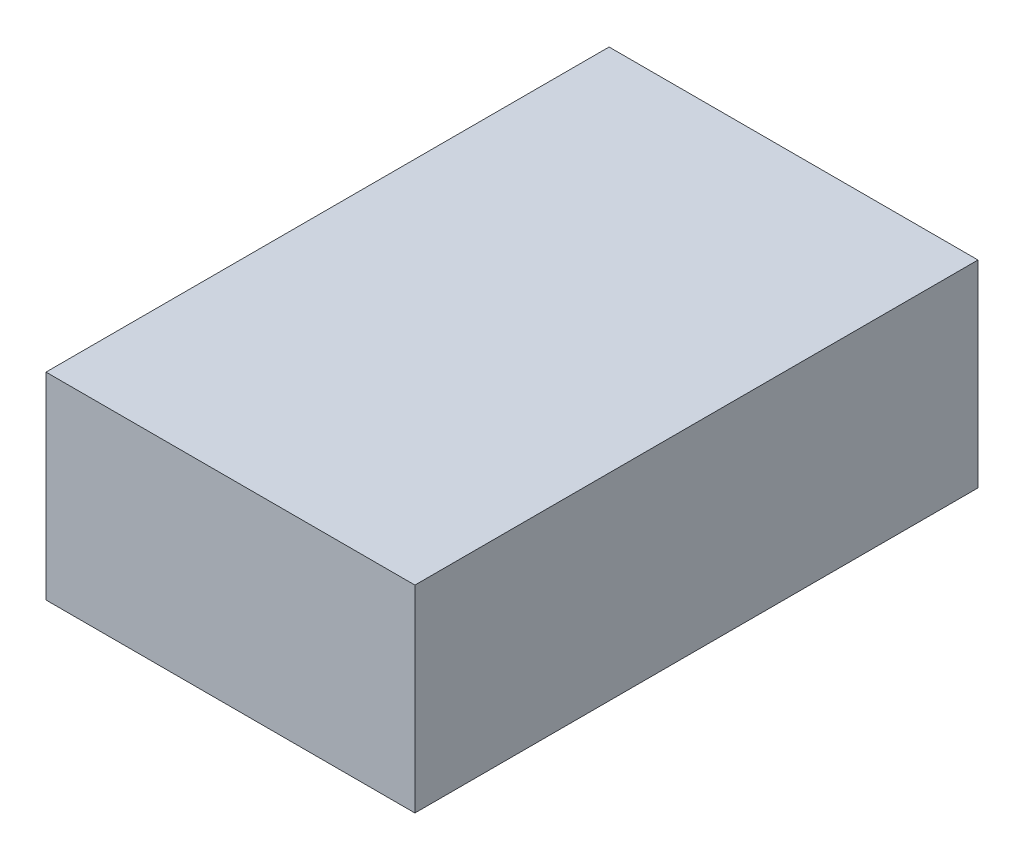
from build123d import *

# Parameters (mm, degrees)
SKETCH1_W           = 57
SKETCH1_H           = 87
BOSS_EXTRUDE1_DEPTH = 30.5


with BuildPart() as part:
    # Sketch1 → Boss-Extrude1 (new body)
    with BuildSketch(Plane(origin=(0, 0, 0), x_dir=(1, 0, 0), z_dir=(0, 1, 0))):
        with Locations((-28.5, 43.5)):
            Rectangle(SKETCH1_W, SKETCH1_H)
    extrude(amount=BOSS_EXTRUDE1_DEPTH)


solid = part.part
